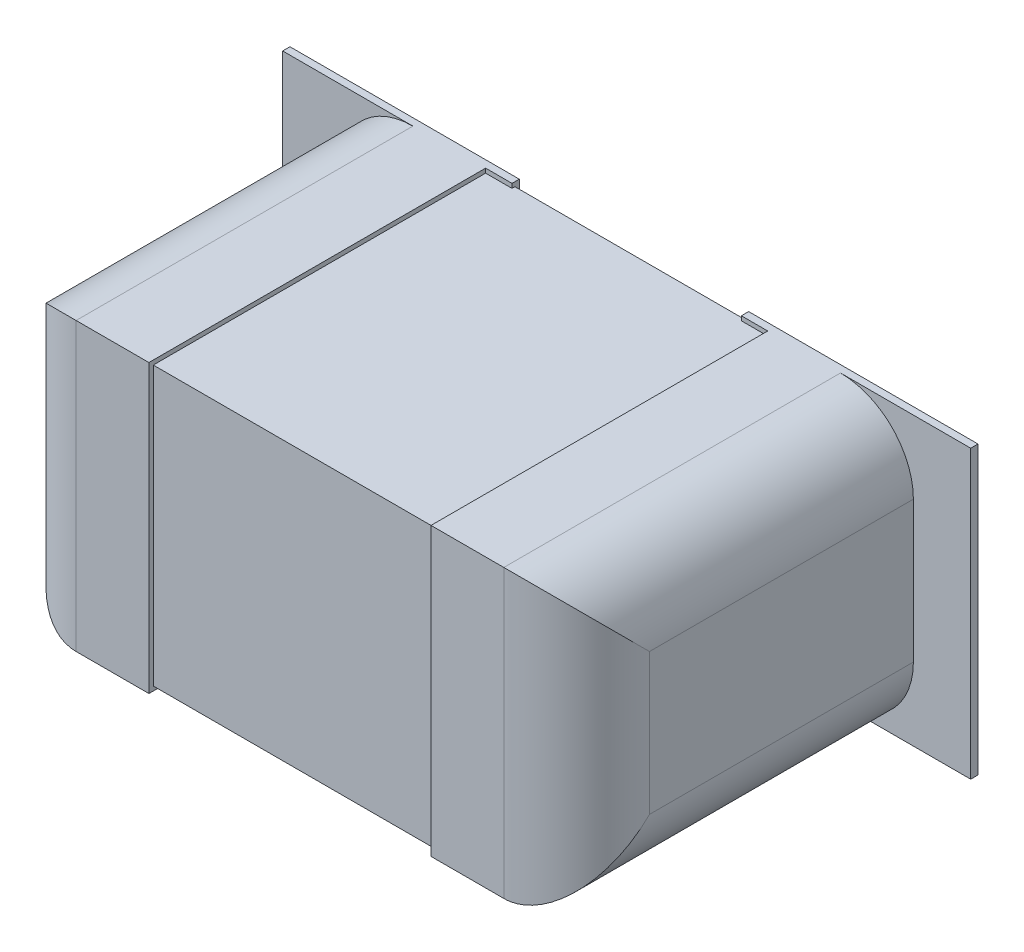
ISO-10303-21;
HEADER;
FILE_DESCRIPTION(('STEP AP214'),'2;1');
FILE_NAME('part.step','',(''),(''),'','','');
FILE_SCHEMA(('AUTOMOTIVE_DESIGN { 1 0 10303 214 1 1 1 1 }'));
ENDSEC;
DATA;
#1=APPLICATION_CONTEXT('core data for automotive mechanical design processes');
#2=APPLICATION_PROTOCOL_DEFINITION('international standard','automotive_design',2000,#1);
#3=PRODUCT_CONTEXT('',#1,'mechanical');
#4=PRODUCT('Part','Part','',(#3));
#5=PRODUCT_RELATED_PRODUCT_CATEGORY('part','',(#4));
#6=PRODUCT_DEFINITION_FORMATION('','',#4);
#7=PRODUCT_DEFINITION_CONTEXT('part definition',#1,'design');
#8=PRODUCT_DEFINITION('design','',#6,#7);
#9=PRODUCT_DEFINITION_SHAPE('','',#8);
#10=(LENGTH_UNIT() NAMED_UNIT(*) SI_UNIT(.MILLI.,.METRE.));
#11=(NAMED_UNIT(*) PLANE_ANGLE_UNIT() SI_UNIT($,.RADIAN.));
#12=(NAMED_UNIT(*) SI_UNIT($,.STERADIAN.) SOLID_ANGLE_UNIT());
#13=UNCERTAINTY_MEASURE_WITH_UNIT(LENGTH_MEASURE(1.E-05),#10,'distance_accuracy_value','');
#14=(GEOMETRIC_REPRESENTATION_CONTEXT(3) GLOBAL_UNCERTAINTY_ASSIGNED_CONTEXT((#13)) GLOBAL_UNIT_ASSIGNED_CONTEXT((#10,
#11,#12)) REPRESENTATION_CONTEXT('',''));
#15=CARTESIAN_POINT('',(0.,0.,0.));
#16=DIRECTION('',(0.,0.,1.));
#17=DIRECTION('',(1.,0.,0.));
#18=AXIS2_PLACEMENT_3D('',#15,#16,#17);
#19=CARTESIAN_POINT('',(0.500000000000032,-0.249999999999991,0.0762));
#20=DIRECTION('',(1.,0.,0.));
#21=DIRECTION('',(0.,0.,-1.));
#22=AXIS2_PLACEMENT_3D('',#19,#20,#21);
#23=PLANE('',#22);
#24=DIRECTION('',(0.,0.,-1.));
#25=VECTOR('',#24,1.);
#26=CARTESIAN_POINT('',(0.500000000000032,-0.122999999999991,0.678388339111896));
#27=LINE('',#26,#25);
#28=CARTESIAN_POINT('',(0.500000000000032,-0.122999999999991,0.0889));
#29=VERTEX_POINT('',#28);
#30=CARTESIAN_POINT('',(0.500000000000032,-0.122999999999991,0.549148));
#31=VERTEX_POINT('',#30);
#32=EDGE_CURVE('E324',#29,#31,#27,.F.);
#33=ORIENTED_EDGE('',*,*,#32,.F.);
#34=DIRECTION('',(0.,1.,0.));
#35=VECTOR('',#34,1.);
#36=CARTESIAN_POINT('',(0.500000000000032,0.,0.0889));
#37=LINE('',#36,#35);
#38=CARTESIAN_POINT('',(0.500000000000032,0.122999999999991,0.0889));
#39=VERTEX_POINT('',#38);
#40=EDGE_CURVE('E237',#39,#29,#37,.F.);
#41=ORIENTED_EDGE('',*,*,#40,.F.);
#42=DIRECTION('',(0.,0.,-1.));
#43=VECTOR('',#42,1.);
#44=CARTESIAN_POINT('',(0.500000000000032,0.122999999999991,0.678388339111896));
#45=LINE('',#44,#43);
#46=CARTESIAN_POINT('',(0.500000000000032,0.122999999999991,0.549148));
#47=VERTEX_POINT('',#46);
#48=EDGE_CURVE('E226',#47,#39,#45,.T.);
#49=ORIENTED_EDGE('',*,*,#48,.F.);
#50=DIRECTION('',(0.,1.,0.));
#51=VECTOR('',#50,1.);
#52=CARTESIAN_POINT('',(0.500000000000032,-0.252159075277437,0.549148));
#53=LINE('',#52,#51);
#54=EDGE_CURVE('E223',#31,#47,#53,.T.);
#55=ORIENTED_EDGE('',*,*,#54,.F.);
#56=EDGE_LOOP('',(#33,#41,#49,#55));
#57=FACE_BOUND('',#56,.T.);
#58=ADVANCED_FACE('F16',(#57),#23,.T.);
#59=CARTESIAN_POINT('',(-0.500000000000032,0.249999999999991,0.0762));
#60=DIRECTION('',(-1.,0.,0.));
#61=DIRECTION('',(0.,0.,1.));
#62=AXIS2_PLACEMENT_3D('',#59,#60,#61);
#63=PLANE('',#62);
#64=DIRECTION('',(0.,0.,-1.));
#65=VECTOR('',#64,1.);
#66=CARTESIAN_POINT('',(-0.500000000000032,0.122999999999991,0.678388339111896));
#67=LINE('',#66,#65);
#68=CARTESIAN_POINT('',(-0.500000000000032,0.122999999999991,0.0889));
#69=VERTEX_POINT('',#68);
#70=CARTESIAN_POINT('',(-0.500000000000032,0.122999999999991,0.549148));
#71=VERTEX_POINT('',#70);
#72=EDGE_CURVE('E308',#69,#71,#67,.F.);
#73=ORIENTED_EDGE('',*,*,#72,.F.);
#74=DIRECTION('',(0.,1.,0.));
#75=VECTOR('',#74,1.);
#76=CARTESIAN_POINT('',(-0.500000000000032,0.,0.0889));
#77=LINE('',#76,#75);
#78=CARTESIAN_POINT('',(-0.500000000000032,-0.122999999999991,0.0889));
#79=VERTEX_POINT('',#78);
#80=EDGE_CURVE('E312',#79,#69,#77,.T.);
#81=ORIENTED_EDGE('',*,*,#80,.F.);
#82=DIRECTION('',(0.,0.,-1.));
#83=VECTOR('',#82,1.);
#84=CARTESIAN_POINT('',(-0.500000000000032,-0.122999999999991,0.678388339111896));
#85=LINE('',#84,#83);
#86=CARTESIAN_POINT('',(-0.500000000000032,-0.122999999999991,0.549148));
#87=VERTEX_POINT('',#86);
#88=EDGE_CURVE('E315',#87,#79,#85,.T.);
#89=ORIENTED_EDGE('',*,*,#88,.F.);
#90=DIRECTION('',(0.,-1.,0.));
#91=VECTOR('',#90,1.);
#92=CARTESIAN_POINT('',(-0.500000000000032,0.252201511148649,0.549148));
#93=LINE('',#92,#91);
#94=EDGE_CURVE('E242',#71,#87,#93,.T.);
#95=ORIENTED_EDGE('',*,*,#94,.F.);
#96=EDGE_LOOP('',(#73,#81,#89,#95));
#97=FACE_BOUND('',#96,.T.);
#98=ADVANCED_FACE('F355',(#97),#63,.T.);
#99=CARTESIAN_POINT('',(-0.373000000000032,0.252201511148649,0.549148));
#100=DIRECTION('',(0.,-1.,0.));
#101=DIRECTION('',(0.,0.,-1.));
#102=AXIS2_PLACEMENT_3D('',#99,#100,#101);
#103=CYLINDRICAL_SURFACE('',#102,0.127);
#104=CARTESIAN_POINT('',(-0.373000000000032,-0.122999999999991,0.549148));
#105=DIRECTION('',(0.,-0.707106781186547,-0.707106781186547));
#106=DIRECTION('',(0.,0.707106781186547,-0.707106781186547));
#107=AXIS2_PLACEMENT_3D('',#104,#105,#106);
#108=ELLIPSE('',#107,0.179605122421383,0.127);
#109=CARTESIAN_POINT('',(-0.373000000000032,-0.249999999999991,0.676148));
#110=VERTEX_POINT('',#109);
#111=EDGE_CURVE('E316',#110,#87,#108,.T.);
#112=ORIENTED_EDGE('',*,*,#111,.F.);
#113=DIRECTION('',(0.,1.,0.));
#114=VECTOR('',#113,1.);
#115=CARTESIAN_POINT('',(-0.373000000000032,0.,0.676148));
#116=LINE('',#115,#114);
#117=CARTESIAN_POINT('',(-0.373000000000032,0.249999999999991,0.676148));
#118=VERTEX_POINT('',#117);
#119=EDGE_CURVE('E207',#118,#110,#116,.F.);
#120=ORIENTED_EDGE('',*,*,#119,.F.);
#121=CARTESIAN_POINT('',(-0.373000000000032,0.122999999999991,0.549148));
#122=DIRECTION('',(0.,0.707106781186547,-0.707106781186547));
#123=DIRECTION('',(0.,-0.707106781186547,-0.707106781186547));
#124=AXIS2_PLACEMENT_3D('',#121,#122,#123);
#125=ELLIPSE('',#124,0.179605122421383,0.127);
#126=EDGE_CURVE('E306',#71,#118,#125,.T.);
#127=ORIENTED_EDGE('',*,*,#126,.F.);
#128=ORIENTED_EDGE('',*,*,#94,.T.);
#129=EDGE_LOOP('',(#112,#120,#127,#128));
#130=FACE_BOUND('',#129,.T.);
#131=ADVANCED_FACE('F360',(#130),#103,.T.);
#132=CARTESIAN_POINT('',(0.373000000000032,-0.252159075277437,0.549148));
#133=DIRECTION('',(0.,1.,0.));
#134=DIRECTION('',(0.,0.,1.));
#135=AXIS2_PLACEMENT_3D('',#132,#133,#134);
#136=CYLINDRICAL_SURFACE('',#135,0.127);
#137=CARTESIAN_POINT('',(0.373000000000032,-0.122999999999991,0.549148));
#138=DIRECTION('',(0.,-0.707106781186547,-0.707106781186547));
#139=DIRECTION('',(0.,0.707106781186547,-0.707106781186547));
#140=AXIS2_PLACEMENT_3D('',#137,#138,#139);
#141=ELLIPSE('',#140,0.179605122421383,0.127);
#142=CARTESIAN_POINT('',(0.373000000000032,-0.249999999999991,0.676148));
#143=VERTEX_POINT('',#142);
#144=EDGE_CURVE('E322',#31,#143,#141,.T.);
#145=ORIENTED_EDGE('',*,*,#144,.F.);
#146=ORIENTED_EDGE('',*,*,#54,.T.);
#147=CARTESIAN_POINT('',(0.373000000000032,0.122999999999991,0.549148));
#148=DIRECTION('',(0.,0.707106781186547,-0.707106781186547));
#149=DIRECTION('',(0.,-0.707106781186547,-0.707106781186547));
#150=AXIS2_PLACEMENT_3D('',#147,#148,#149);
#151=ELLIPSE('',#150,0.179605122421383,0.127);
#152=CARTESIAN_POINT('',(0.373000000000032,0.249999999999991,0.676148));
#153=VERTEX_POINT('',#152);
#154=EDGE_CURVE('E19',#153,#47,#151,.T.);
#155=ORIENTED_EDGE('',*,*,#154,.F.);
#156=DIRECTION('',(0.,1.,0.));
#157=VECTOR('',#156,1.);
#158=CARTESIAN_POINT('',(0.373000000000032,0.,0.676148));
#159=LINE('',#158,#157);
#160=EDGE_CURVE('E197',#143,#153,#159,.T.);
#161=ORIENTED_EDGE('',*,*,#160,.F.);
#162=EDGE_LOOP('',(#145,#146,#155,#161));
#163=FACE_BOUND('',#162,.T.);
#164=ADVANCED_FACE('F221',(#163),#136,.T.);
#165=CARTESIAN_POINT('',(0.373000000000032,0.122999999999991,0.678388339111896));
#166=DIRECTION('',(0.,0.,-1.));
#167=DIRECTION('',(-1.,0.,0.));
#168=AXIS2_PLACEMENT_3D('',#165,#166,#167);
#169=CYLINDRICAL_SURFACE('',#168,0.127);
#170=ORIENTED_EDGE('',*,*,#48,.T.);
#171=CARTESIAN_POINT('',(0.373000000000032,0.122999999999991,0.0889));
#172=DIRECTION('',(0.,0.,-1.));
#173=DIRECTION('',(-1.,0.,0.));
#174=AXIS2_PLACEMENT_3D('',#171,#172,#173);
#175=CIRCLE('',#174,0.127);
#176=CARTESIAN_POINT('',(0.37286056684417,0.249999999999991,0.0889000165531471));
#177=VERTEX_POINT('',#176);
#178=EDGE_CURVE('E229',#177,#39,#175,.T.);
#179=ORIENTED_EDGE('',*,*,#178,.F.);
#180=DIRECTION('',(-0.000237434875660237,0.,-0.999999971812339));
#181=VECTOR('',#180,1.);
#182=CARTESIAN_POINT('',(0.373000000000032,0.249999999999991,0.676148));
#183=LINE('',#182,#181);
#184=EDGE_CURVE('E214',#153,#177,#183,.T.);
#185=ORIENTED_EDGE('',*,*,#184,.F.);
#186=ORIENTED_EDGE('',*,*,#154,.T.);
#187=EDGE_LOOP('',(#170,#179,#185,#186));
#188=FACE_BOUND('',#187,.T.);
#189=ADVANCED_FACE('F227',(#188),#169,.T.);
#190=CARTESIAN_POINT('',(0.5999988,-0.2500122,0.0762));
#191=DIRECTION('',(1.,0.,0.));
#192=DIRECTION('',(0.,0.,-1.));
#193=AXIS2_PLACEMENT_3D('',#190,#191,#192);
#194=PLANE('',#193);
#195=DIRECTION('',(0.,0.,-1.));
#196=VECTOR('',#195,1.);
#197=CARTESIAN_POINT('',(0.5999988,-0.249999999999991,0.0762));
#198=LINE('',#197,#196);
#199=CARTESIAN_POINT('',(0.5999988,-0.249999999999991,0.0762));
#200=VERTEX_POINT('',#199);
#201=CARTESIAN_POINT('',(0.5999988,-0.249999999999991,0.0889));
#202=VERTEX_POINT('',#201);
#203=EDGE_CURVE('E294',#200,#202,#198,.F.);
#204=ORIENTED_EDGE('',*,*,#203,.F.);
#205=DIRECTION('',(0.,1.,0.));
#206=VECTOR('',#205,1.);
#207=CARTESIAN_POINT('',(0.5999988,0.,0.0762));
#208=LINE('',#207,#206);
#209=CARTESIAN_POINT('',(0.5999988,0.249999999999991,0.0762));
#210=VERTEX_POINT('',#209);
#211=EDGE_CURVE('E297',#200,#210,#208,.T.);
#212=ORIENTED_EDGE('',*,*,#211,.T.);
#213=DIRECTION('',(0.,0.,1.));
#214=VECTOR('',#213,1.);
#215=CARTESIAN_POINT('',(0.5999988,0.249999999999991,0.0762));
#216=LINE('',#215,#214);
#217=CARTESIAN_POINT('',(0.5999988,0.249999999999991,0.0889));
#218=VERTEX_POINT('',#217);
#219=EDGE_CURVE('E233',#218,#210,#216,.F.);
#220=ORIENTED_EDGE('',*,*,#219,.F.);
#221=DIRECTION('',(0.,1.,0.));
#222=VECTOR('',#221,1.);
#223=CARTESIAN_POINT('',(0.5999988,0.,0.0889));
#224=LINE('',#223,#222);
#225=EDGE_CURVE('E240',#202,#218,#224,.T.);
#226=ORIENTED_EDGE('',*,*,#225,.F.);
#227=EDGE_LOOP('',(#204,#212,#220,#226));
#228=FACE_BOUND('',#227,.T.);
#229=ADVANCED_FACE('F335',(#228),#194,.T.);
#230=CARTESIAN_POINT('',(0.,0.,0.0889));
#231=DIRECTION('',(0.,0.,1.));
#232=DIRECTION('',(1.,0.,0.));
#233=AXIS2_PLACEMENT_3D('',#230,#231,#232);
#234=PLANE('',#233);
#235=ORIENTED_EDGE('',*,*,#178,.T.);
#236=ORIENTED_EDGE('',*,*,#40,.T.);
#237=CARTESIAN_POINT('',(0.373000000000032,-0.122999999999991,0.0889));
#238=DIRECTION('',(0.,0.,-1.));
#239=DIRECTION('',(-1.,0.,0.));
#240=AXIS2_PLACEMENT_3D('',#237,#238,#239);
#241=CIRCLE('',#240,0.127);
#242=CARTESIAN_POINT('',(0.37286056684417,-0.249999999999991,0.088900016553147));
#243=VERTEX_POINT('',#242);
#244=EDGE_CURVE('E319',#243,#29,#241,.F.);
#245=ORIENTED_EDGE('',*,*,#244,.F.);
#246=DIRECTION('',(1.,0.,0.));
#247=VECTOR('',#246,1.);
#248=CARTESIAN_POINT('',(-0.500000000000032,-0.249999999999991,0.0889));
#249=LINE('',#248,#247);
#250=EDGE_CURVE('E296',#202,#243,#249,.F.);
#251=ORIENTED_EDGE('',*,*,#250,.F.);
#252=ORIENTED_EDGE('',*,*,#225,.T.);
#253=DIRECTION('',(1.,0.,0.));
#254=VECTOR('',#253,1.);
#255=CARTESIAN_POINT('',(0.500000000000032,0.249999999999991,0.0889));
#256=LINE('',#255,#254);
#257=EDGE_CURVE('E231',#177,#218,#256,.T.);
#258=ORIENTED_EDGE('',*,*,#257,.F.);
#259=EDGE_LOOP('',(#235,#236,#245,#251,#252,#258));
#260=FACE_BOUND('',#259,.T.);
#261=ADVANCED_FACE('F328',(#260),#234,.T.);
#262=CARTESIAN_POINT('',(0.373000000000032,-0.122999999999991,0.678388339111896));
#263=DIRECTION('',(0.,0.,-1.));
#264=DIRECTION('',(-1.,0.,0.));
#265=AXIS2_PLACEMENT_3D('',#262,#263,#264);
#266=CYLINDRICAL_SURFACE('',#265,0.127);
#267=DIRECTION('',(0.000237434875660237,0.,0.999999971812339));
#268=VECTOR('',#267,1.);
#269=CARTESIAN_POINT('',(0.37286056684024,-0.249999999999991,0.0889));
#270=LINE('',#269,#268);
#271=EDGE_CURVE('E342',#243,#143,#270,.T.);
#272=ORIENTED_EDGE('',*,*,#271,.F.);
#273=ORIENTED_EDGE('',*,*,#244,.T.);
#274=ORIENTED_EDGE('',*,*,#32,.T.);
#275=ORIENTED_EDGE('',*,*,#144,.T.);
#276=EDGE_LOOP('',(#272,#273,#274,#275));
#277=FACE_BOUND('',#276,.T.);
#278=ADVANCED_FACE('F352',(#277),#266,.T.);
#279=CARTESIAN_POINT('',(-0.373000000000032,-0.122999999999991,0.678388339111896));
#280=DIRECTION('',(0.,0.,-1.));
#281=DIRECTION('',(-1.,0.,0.));
#282=AXIS2_PLACEMENT_3D('',#279,#280,#281);
#283=CYLINDRICAL_SURFACE('',#282,0.127);
#284=ORIENTED_EDGE('',*,*,#88,.T.);
#285=CARTESIAN_POINT('',(-0.373000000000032,-0.122999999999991,0.0889));
#286=DIRECTION('',(0.,0.,-1.));
#287=DIRECTION('',(-1.,0.,0.));
#288=AXIS2_PLACEMENT_3D('',#285,#286,#287);
#289=CIRCLE('',#288,0.127);
#290=CARTESIAN_POINT('',(-0.37286056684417,-0.249999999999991,0.0889000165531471));
#291=VERTEX_POINT('',#290);
#292=EDGE_CURVE('E309',#291,#79,#289,.T.);
#293=ORIENTED_EDGE('',*,*,#292,.F.);
#294=DIRECTION('',(0.000237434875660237,0.,-0.999999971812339));
#295=VECTOR('',#294,1.);
#296=CARTESIAN_POINT('',(-0.373000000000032,-0.249999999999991,0.676148));
#297=LINE('',#296,#295);
#298=EDGE_CURVE('E289',#110,#291,#297,.T.);
#299=ORIENTED_EDGE('',*,*,#298,.F.);
#300=ORIENTED_EDGE('',*,*,#111,.T.);
#301=EDGE_LOOP('',(#284,#293,#299,#300));
#302=FACE_BOUND('',#301,.T.);
#303=ADVANCED_FACE('F449',(#302),#283,.T.);
#304=CARTESIAN_POINT('',(-0.5999988,0.2500122,0.0762));
#305=DIRECTION('',(-1.,0.,0.));
#306=DIRECTION('',(0.,0.,1.));
#307=AXIS2_PLACEMENT_3D('',#304,#305,#306);
#308=PLANE('',#307);
#309=DIRECTION('',(0.,0.,1.));
#310=VECTOR('',#309,1.);
#311=CARTESIAN_POINT('',(-0.5999988,0.249999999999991,0.0762));
#312=LINE('',#311,#310);
#313=CARTESIAN_POINT('',(-0.5999988,0.249999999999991,0.0762));
#314=VERTEX_POINT('',#313);
#315=CARTESIAN_POINT('',(-0.5999988,0.249999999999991,0.0889));
#316=VERTEX_POINT('',#315);
#317=EDGE_CURVE('E277',#314,#316,#312,.T.);
#318=ORIENTED_EDGE('',*,*,#317,.F.);
#319=DIRECTION('',(0.,1.,0.));
#320=VECTOR('',#319,1.);
#321=CARTESIAN_POINT('',(-0.5999988,0.,0.0762));
#322=LINE('',#321,#320);
#323=CARTESIAN_POINT('',(-0.5999988,-0.249999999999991,0.0762));
#324=VERTEX_POINT('',#323);
#325=EDGE_CURVE('E280',#314,#324,#322,.F.);
#326=ORIENTED_EDGE('',*,*,#325,.T.);
#327=DIRECTION('',(0.,0.,-1.));
#328=VECTOR('',#327,1.);
#329=CARTESIAN_POINT('',(-0.5999988,-0.249999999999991,0.0762));
#330=LINE('',#329,#328);
#331=CARTESIAN_POINT('',(-0.5999988,-0.249999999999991,0.0889));
#332=VERTEX_POINT('',#331);
#333=EDGE_CURVE('E284',#332,#324,#330,.T.);
#334=ORIENTED_EDGE('',*,*,#333,.F.);
#335=DIRECTION('',(0.,1.,0.));
#336=VECTOR('',#335,1.);
#337=CARTESIAN_POINT('',(-0.5999988,0.,0.0889));
#338=LINE('',#337,#336);
#339=EDGE_CURVE('E313',#316,#332,#338,.F.);
#340=ORIENTED_EDGE('',*,*,#339,.F.);
#341=EDGE_LOOP('',(#318,#326,#334,#340));
#342=FACE_BOUND('',#341,.T.);
#343=ADVANCED_FACE('F445',(#342),#308,.T.);
#344=CARTESIAN_POINT('',(0.,0.,0.0889));
#345=DIRECTION('',(0.,0.,1.));
#346=DIRECTION('',(1.,0.,0.));
#347=AXIS2_PLACEMENT_3D('',#344,#345,#346);
#348=PLANE('',#347);
#349=ORIENTED_EDGE('',*,*,#292,.T.);
#350=ORIENTED_EDGE('',*,*,#80,.T.);
#351=CARTESIAN_POINT('',(-0.373000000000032,0.122999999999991,0.0889));
#352=DIRECTION('',(0.,0.,-1.));
#353=DIRECTION('',(-1.,0.,0.));
#354=AXIS2_PLACEMENT_3D('',#351,#352,#353);
#355=CIRCLE('',#354,0.127);
#356=CARTESIAN_POINT('',(-0.37286056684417,0.249999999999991,0.088900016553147));
#357=VERTEX_POINT('',#356);
#358=EDGE_CURVE('E303',#357,#69,#355,.F.);
#359=ORIENTED_EDGE('',*,*,#358,.F.);
#360=DIRECTION('',(1.,0.,0.));
#361=VECTOR('',#360,1.);
#362=CARTESIAN_POINT('',(0.500000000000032,0.249999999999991,0.0889));
#363=LINE('',#362,#361);
#364=EDGE_CURVE('E279',#316,#357,#363,.T.);
#365=ORIENTED_EDGE('',*,*,#364,.F.);
#366=ORIENTED_EDGE('',*,*,#339,.T.);
#367=DIRECTION('',(1.,0.,0.));
#368=VECTOR('',#367,1.);
#369=CARTESIAN_POINT('',(-0.500000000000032,-0.249999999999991,0.0889));
#370=LINE('',#369,#368);
#371=EDGE_CURVE('E286',#291,#332,#370,.F.);
#372=ORIENTED_EDGE('',*,*,#371,.F.);
#373=EDGE_LOOP('',(#349,#350,#359,#365,#366,#372));
#374=FACE_BOUND('',#373,.T.);
#375=ADVANCED_FACE('F441',(#374),#348,.T.);
#376=CARTESIAN_POINT('',(-0.373000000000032,0.122999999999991,0.678388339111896));
#377=DIRECTION('',(0.,0.,-1.));
#378=DIRECTION('',(-1.,0.,0.));
#379=AXIS2_PLACEMENT_3D('',#376,#377,#378);
#380=CYLINDRICAL_SURFACE('',#379,0.127);
#381=DIRECTION('',(-0.000237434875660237,0.,0.999999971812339));
#382=VECTOR('',#381,1.);
#383=CARTESIAN_POINT('',(-0.37286056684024,0.249999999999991,0.0889));
#384=LINE('',#383,#382);
#385=EDGE_CURVE('E482',#357,#118,#384,.T.);
#386=ORIENTED_EDGE('',*,*,#385,.F.);
#387=ORIENTED_EDGE('',*,*,#358,.T.);
#388=ORIENTED_EDGE('',*,*,#72,.T.);
#389=ORIENTED_EDGE('',*,*,#126,.T.);
#390=EDGE_LOOP('',(#386,#387,#388,#389));
#391=FACE_BOUND('',#390,.T.);
#392=ADVANCED_FACE('F437',(#391),#380,.T.);
#393=CARTESIAN_POINT('',(0.,0.,0.676148));
#394=DIRECTION('',(0.,0.,1.));
#395=DIRECTION('',(1.,0.,0.));
#396=AXIS2_PLACEMENT_3D('',#393,#394,#395);
#397=PLANE('',#396);
#398=DIRECTION('',(1.,0.,0.));
#399=VECTOR('',#398,1.);
#400=CARTESIAN_POINT('',(0.500000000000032,0.249999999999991,0.676148));
#401=LINE('',#400,#399);
#402=CARTESIAN_POINT('',(-0.246000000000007,0.249999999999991,0.676148));
#403=VERTEX_POINT('',#402);
#404=EDGE_CURVE('E276',#118,#403,#401,.T.);
#405=ORIENTED_EDGE('',*,*,#404,.F.);
#406=ORIENTED_EDGE('',*,*,#119,.T.);
#407=DIRECTION('',(1.,0.,0.));
#408=VECTOR('',#407,1.);
#409=CARTESIAN_POINT('',(-0.500000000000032,-0.249999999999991,0.676148));
#410=LINE('',#409,#408);
#411=CARTESIAN_POINT('',(-0.246000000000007,-0.250002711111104,0.676148));
#412=VERTEX_POINT('',#411);
#413=EDGE_CURVE('E293',#412,#110,#410,.F.);
#414=ORIENTED_EDGE('',*,*,#413,.F.);
#415=DIRECTION('',(0.,1.,0.));
#416=VECTOR('',#415,1.);
#417=CARTESIAN_POINT('',(-0.246000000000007,-0.249999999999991,0.676148));
#418=LINE('',#417,#416);
#419=EDGE_CURVE('E513',#412,#403,#418,.T.);
#420=ORIENTED_EDGE('',*,*,#419,.T.);
#421=EDGE_LOOP('',(#405,#406,#414,#420));
#422=FACE_BOUND('',#421,.T.);
#423=ADVANCED_FACE('F434',(#422),#397,.T.);
#424=CARTESIAN_POINT('',(0.,0.,0.676148));
#425=DIRECTION('',(0.,0.,1.));
#426=DIRECTION('',(1.,0.,0.));
#427=AXIS2_PLACEMENT_3D('',#424,#425,#426);
#428=PLANE('',#427);
#429=DIRECTION('',(1.,0.,0.));
#430=VECTOR('',#429,1.);
#431=CARTESIAN_POINT('',(-0.500000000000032,-0.249999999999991,0.676148));
#432=LINE('',#431,#430);
#433=CARTESIAN_POINT('',(0.246000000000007,-0.249999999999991,0.676148));
#434=VERTEX_POINT('',#433);
#435=EDGE_CURVE('E203',#143,#434,#432,.F.);
#436=ORIENTED_EDGE('',*,*,#435,.F.);
#437=ORIENTED_EDGE('',*,*,#160,.T.);
#438=DIRECTION('',(1.,0.,0.));
#439=VECTOR('',#438,1.);
#440=CARTESIAN_POINT('',(0.500000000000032,0.249999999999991,0.676148));
#441=LINE('',#440,#439);
#442=CARTESIAN_POINT('',(0.246000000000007,0.250002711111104,0.676148));
#443=VERTEX_POINT('',#442);
#444=EDGE_CURVE('E201',#443,#153,#441,.T.);
#445=ORIENTED_EDGE('',*,*,#444,.F.);
#446=DIRECTION('',(0.,1.,0.));
#447=VECTOR('',#446,1.);
#448=CARTESIAN_POINT('',(0.246000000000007,-0.249999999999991,0.676148));
#449=LINE('',#448,#447);
#450=EDGE_CURVE('E568',#443,#434,#449,.F.);
#451=ORIENTED_EDGE('',*,*,#450,.T.);
#452=EDGE_LOOP('',(#436,#437,#445,#451));
#453=FACE_BOUND('',#452,.T.);
#454=ADVANCED_FACE('F199',(#453),#428,.T.);
#455=CARTESIAN_POINT('',(0.,0.,0.0889));
#456=DIRECTION('',(0.,0.,1.));
#457=DIRECTION('',(1.,0.,0.));
#458=AXIS2_PLACEMENT_3D('',#455,#456,#457);
#459=PLANE('',#458);
#460=DIRECTION('',(1.,0.,0.));
#461=VECTOR('',#460,1.);
#462=CARTESIAN_POINT('',(-0.246000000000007,0.242379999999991,0.0889));
#463=LINE('',#462,#461);
#464=CARTESIAN_POINT('',(0.1999996,0.242379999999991,0.0889));
#465=VERTEX_POINT('',#464);
#466=CARTESIAN_POINT('',(0.246000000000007,0.242379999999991,0.0889));
#467=VERTEX_POINT('',#466);
#468=EDGE_CURVE('E529',#465,#467,#463,.T.);
#469=ORIENTED_EDGE('',*,*,#468,.T.);
#470=DIRECTION('',(0.,1.,0.));
#471=VECTOR('',#470,1.);
#472=CARTESIAN_POINT('',(0.246000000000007,-0.249999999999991,0.0889));
#473=LINE('',#472,#471);
#474=CARTESIAN_POINT('',(0.246000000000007,0.250002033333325,0.0889));
#475=VERTEX_POINT('',#474);
#476=EDGE_CURVE('E558',#467,#475,#473,.T.);
#477=ORIENTED_EDGE('',*,*,#476,.T.);
#478=DIRECTION('',(1.,0.,0.));
#479=VECTOR('',#478,1.);
#480=CARTESIAN_POINT('',(0.500000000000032,0.249999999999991,0.0889));
#481=LINE('',#480,#479);
#482=CARTESIAN_POINT('',(0.1999996,0.249999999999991,0.0889));
#483=VERTEX_POINT('',#482);
#484=EDGE_CURVE('E301',#483,#475,#481,.T.);
#485=ORIENTED_EDGE('',*,*,#484,.F.);
#486=DIRECTION('',(0.,1.,0.));
#487=VECTOR('',#486,1.);
#488=CARTESIAN_POINT('',(0.1999996,0.2500122,0.0889));
#489=LINE('',#488,#487);
#490=EDGE_CURVE('E257',#465,#483,#489,.T.);
#491=ORIENTED_EDGE('',*,*,#490,.F.);
#492=EDGE_LOOP('',(#469,#477,#485,#491));
#493=FACE_BOUND('',#492,.T.);
#494=ADVANCED_FACE('F428',(#493),#459,.T.);
#495=CARTESIAN_POINT('',(0.500000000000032,0.249999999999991,0.0762));
#496=DIRECTION('',(0.,1.,0.));
#497=DIRECTION('',(0.,0.,1.));
#498=AXIS2_PLACEMENT_3D('',#495,#496,#497);
#499=PLANE('',#498);
#500=ORIENTED_EDGE('',*,*,#484,.T.);
#501=DIRECTION('',(0.,0.,-1.));
#502=VECTOR('',#501,1.);
#503=CARTESIAN_POINT('',(0.246000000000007,0.25000406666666,0.08382));
#504=LINE('',#503,#502);
#505=EDGE_CURVE('E217',#475,#443,#504,.F.);
#506=ORIENTED_EDGE('',*,*,#505,.T.);
#507=ORIENTED_EDGE('',*,*,#444,.T.);
#508=ORIENTED_EDGE('',*,*,#184,.T.);
#509=ORIENTED_EDGE('',*,*,#257,.T.);
#510=ORIENTED_EDGE('',*,*,#219,.T.);
#511=DIRECTION('',(1.,0.,0.));
#512=VECTOR('',#511,1.);
#513=CARTESIAN_POINT('',(0.500000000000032,0.249999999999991,0.0762));
#514=LINE('',#513,#512);
#515=CARTESIAN_POINT('',(0.1999996,0.249999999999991,0.0762));
#516=VERTEX_POINT('',#515);
#517=EDGE_CURVE('E298',#210,#516,#514,.F.);
#518=ORIENTED_EDGE('',*,*,#517,.T.);
#519=DIRECTION('',(0.,0.,-1.));
#520=VECTOR('',#519,1.);
#521=CARTESIAN_POINT('',(0.1999996,0.249999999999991,0.0762));
#522=LINE('',#521,#520);
#523=EDGE_CURVE('E255',#483,#516,#522,.T.);
#524=ORIENTED_EDGE('',*,*,#523,.F.);
#525=EDGE_LOOP('',(#500,#506,#507,#508,#509,#510,#518,#524));
#526=FACE_BOUND('',#525,.T.);
#527=ADVANCED_FACE('F211',(#526),#499,.T.);
#528=CARTESIAN_POINT('',(0.,0.,0.0762));
#529=DIRECTION('',(0.,0.,1.));
#530=DIRECTION('',(1.,0.,0.));
#531=AXIS2_PLACEMENT_3D('',#528,#529,#530);
#532=PLANE('',#531);
#533=DIRECTION('',(1.,0.,0.));
#534=VECTOR('',#533,1.);
#535=CARTESIAN_POINT('',(-0.500000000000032,-0.249999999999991,0.0762));
#536=LINE('',#535,#534);
#537=CARTESIAN_POINT('',(0.1999996,-0.249999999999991,0.0762));
#538=VERTEX_POINT('',#537);
#539=EDGE_CURVE('E290',#538,#200,#536,.T.);
#540=ORIENTED_EDGE('',*,*,#539,.F.);
#541=DIRECTION('',(0.,1.,0.));
#542=VECTOR('',#541,1.);
#543=CARTESIAN_POINT('',(0.1999996,0.2500122,0.0762));
#544=LINE('',#543,#542);
#545=EDGE_CURVE('E254',#516,#538,#544,.F.);
#546=ORIENTED_EDGE('',*,*,#545,.F.);
#547=ORIENTED_EDGE('',*,*,#517,.F.);
#548=ORIENTED_EDGE('',*,*,#211,.F.);
#549=EDGE_LOOP('',(#540,#546,#547,#548));
#550=FACE_BOUND('',#549,.T.);
#551=ADVANCED_FACE('F423',(#550),#532,.F.);
#552=CARTESIAN_POINT('',(-0.500000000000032,-0.249999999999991,0.0762));
#553=DIRECTION('',(0.,-1.,0.));
#554=DIRECTION('',(0.,0.,-1.));
#555=AXIS2_PLACEMENT_3D('',#552,#553,#554);
#556=PLANE('',#555);
#557=DIRECTION('',(0.,0.,1.));
#558=VECTOR('',#557,1.);
#559=CARTESIAN_POINT('',(0.1999996,-0.249999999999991,0.0762));
#560=LINE('',#559,#558);
#561=CARTESIAN_POINT('',(0.1999996,-0.249999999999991,0.0889));
#562=VERTEX_POINT('',#561);
#563=EDGE_CURVE('E251',#538,#562,#560,.T.);
#564=ORIENTED_EDGE('',*,*,#563,.F.);
#565=ORIENTED_EDGE('',*,*,#539,.T.);
#566=ORIENTED_EDGE('',*,*,#203,.T.);
#567=ORIENTED_EDGE('',*,*,#250,.T.);
#568=ORIENTED_EDGE('',*,*,#271,.T.);
#569=ORIENTED_EDGE('',*,*,#435,.T.);
#570=DIRECTION('',(0.,0.,-1.));
#571=VECTOR('',#570,1.);
#572=CARTESIAN_POINT('',(0.246000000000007,-0.249999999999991,0.08382));
#573=LINE('',#572,#571);
#574=CARTESIAN_POINT('',(0.246000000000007,-0.249999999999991,0.0889));
#575=VERTEX_POINT('',#574);
#576=EDGE_CURVE('E264',#434,#575,#573,.T.);
#577=ORIENTED_EDGE('',*,*,#576,.T.);
#578=DIRECTION('',(1.,0.,0.));
#579=VECTOR('',#578,1.);
#580=CARTESIAN_POINT('',(0.,-0.249999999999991,0.0889));
#581=LINE('',#580,#579);
#582=EDGE_CURVE('E258',#562,#575,#581,.T.);
#583=ORIENTED_EDGE('',*,*,#582,.F.);
#584=EDGE_LOOP('',(#564,#565,#566,#567,#568,#569,#577,#583));
#585=FACE_BOUND('',#584,.T.);
#586=ADVANCED_FACE('F347',(#585),#556,.T.);
#587=CARTESIAN_POINT('',(-0.500000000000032,-0.249999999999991,0.0762));
#588=DIRECTION('',(0.,-1.,0.));
#589=DIRECTION('',(0.,0.,-1.));
#590=AXIS2_PLACEMENT_3D('',#587,#588,#589);
#591=PLANE('',#590);
#592=DIRECTION('',(1.,0.,0.));
#593=VECTOR('',#592,1.);
#594=CARTESIAN_POINT('',(0.,-0.25000406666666,0.0889));
#595=LINE('',#594,#593);
#596=CARTESIAN_POINT('',(-0.246000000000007,-0.250003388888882,0.0889));
#597=VERTEX_POINT('',#596);
#598=CARTESIAN_POINT('',(-0.1999996,-0.250002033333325,0.0889));
#599=VERTEX_POINT('',#598);
#600=EDGE_CURVE('E506',#597,#599,#595,.T.);
#601=ORIENTED_EDGE('',*,*,#600,.F.);
#602=DIRECTION('',(0.,0.,1.));
#603=VECTOR('',#602,1.);
#604=CARTESIAN_POINT('',(-0.246000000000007,-0.25000406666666,0.0762));
#605=LINE('',#604,#603);
#606=EDGE_CURVE('E505',#597,#412,#605,.T.);
#607=ORIENTED_EDGE('',*,*,#606,.T.);
#608=ORIENTED_EDGE('',*,*,#413,.T.);
#609=ORIENTED_EDGE('',*,*,#298,.T.);
#610=ORIENTED_EDGE('',*,*,#371,.T.);
#611=ORIENTED_EDGE('',*,*,#333,.T.);
#612=DIRECTION('',(1.,0.,0.));
#613=VECTOR('',#612,1.);
#614=CARTESIAN_POINT('',(-0.500000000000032,-0.249999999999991,0.0762));
#615=LINE('',#614,#613);
#616=CARTESIAN_POINT('',(-0.1999996,-0.249999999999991,0.0762));
#617=VERTEX_POINT('',#616);
#618=EDGE_CURVE('E281',#324,#617,#615,.T.);
#619=ORIENTED_EDGE('',*,*,#618,.T.);
#620=DIRECTION('',(0.,0.,-1.));
#621=VECTOR('',#620,1.);
#622=CARTESIAN_POINT('',(-0.1999996,-0.249999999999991,0.0762));
#623=LINE('',#622,#621);
#624=EDGE_CURVE('E248',#599,#617,#623,.T.);
#625=ORIENTED_EDGE('',*,*,#624,.F.);
#626=EDGE_LOOP('',(#601,#607,#608,#609,#610,#611,#619,#625));
#627=FACE_BOUND('',#626,.T.);
#628=ADVANCED_FACE('F416',(#627),#591,.T.);
#629=CARTESIAN_POINT('',(0.,0.,0.0762));
#630=DIRECTION('',(0.,0.,1.));
#631=DIRECTION('',(1.,0.,0.));
#632=AXIS2_PLACEMENT_3D('',#629,#630,#631);
#633=PLANE('',#632);
#634=DIRECTION('',(1.,0.,0.));
#635=VECTOR('',#634,1.);
#636=CARTESIAN_POINT('',(0.500000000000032,0.249999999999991,0.0762));
#637=LINE('',#636,#635);
#638=CARTESIAN_POINT('',(-0.1999996,0.249999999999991,0.0762));
#639=VERTEX_POINT('',#638);
#640=EDGE_CURVE('E273',#639,#314,#637,.F.);
#641=ORIENTED_EDGE('',*,*,#640,.F.);
#642=DIRECTION('',(0.,1.,0.));
#643=VECTOR('',#642,1.);
#644=CARTESIAN_POINT('',(-0.1999996,-0.2500122,0.0762));
#645=LINE('',#644,#643);
#646=EDGE_CURVE('E247',#617,#639,#645,.T.);
#647=ORIENTED_EDGE('',*,*,#646,.F.);
#648=ORIENTED_EDGE('',*,*,#618,.F.);
#649=ORIENTED_EDGE('',*,*,#325,.F.);
#650=EDGE_LOOP('',(#641,#647,#648,#649));
#651=FACE_BOUND('',#650,.T.);
#652=ADVANCED_FACE('F412',(#651),#633,.F.);
#653=CARTESIAN_POINT('',(0.500000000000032,0.249999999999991,0.0762));
#654=DIRECTION('',(0.,1.,0.));
#655=DIRECTION('',(0.,0.,1.));
#656=AXIS2_PLACEMENT_3D('',#653,#654,#655);
#657=PLANE('',#656);
#658=DIRECTION('',(0.,0.,1.));
#659=VECTOR('',#658,1.);
#660=CARTESIAN_POINT('',(-0.1999996,0.249999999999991,0.0762));
#661=LINE('',#660,#659);
#662=CARTESIAN_POINT('',(-0.1999996,0.249999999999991,0.0889));
#663=VERTEX_POINT('',#662);
#664=EDGE_CURVE('E244',#639,#663,#661,.T.);
#665=ORIENTED_EDGE('',*,*,#664,.F.);
#666=ORIENTED_EDGE('',*,*,#640,.T.);
#667=ORIENTED_EDGE('',*,*,#317,.T.);
#668=ORIENTED_EDGE('',*,*,#364,.T.);
#669=ORIENTED_EDGE('',*,*,#385,.T.);
#670=ORIENTED_EDGE('',*,*,#404,.T.);
#671=DIRECTION('',(0.,0.,1.));
#672=VECTOR('',#671,1.);
#673=CARTESIAN_POINT('',(-0.246000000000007,0.249999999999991,0.0762));
#674=LINE('',#673,#672);
#675=CARTESIAN_POINT('',(-0.246000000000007,0.249999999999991,0.0889));
#676=VERTEX_POINT('',#675);
#677=EDGE_CURVE('E269',#403,#676,#674,.F.);
#678=ORIENTED_EDGE('',*,*,#677,.T.);
#679=DIRECTION('',(-1.,0.,0.));
#680=VECTOR('',#679,1.);
#681=CARTESIAN_POINT('',(0.,0.249999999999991,0.0889));
#682=LINE('',#681,#680);
#683=EDGE_CURVE('E270',#663,#676,#682,.T.);
#684=ORIENTED_EDGE('',*,*,#683,.F.);
#685=EDGE_LOOP('',(#665,#666,#667,#668,#669,#670,#678,#684));
#686=FACE_BOUND('',#685,.T.);
#687=ADVANCED_FACE('F408',(#686),#657,.T.);
#688=CARTESIAN_POINT('',(0.,0.,0.0889));
#689=DIRECTION('',(0.,0.,1.));
#690=DIRECTION('',(1.,0.,0.));
#691=AXIS2_PLACEMENT_3D('',#688,#689,#690);
#692=PLANE('',#691);
#693=DIRECTION('',(0.,1.,0.));
#694=VECTOR('',#693,1.);
#695=CARTESIAN_POINT('',(-0.1999996,-0.2500122,0.0889));
#696=LINE('',#695,#694);
#697=CARTESIAN_POINT('',(-0.1999996,0.242379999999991,0.0889));
#698=VERTEX_POINT('',#697);
#699=EDGE_CURVE('E246',#663,#698,#696,.F.);
#700=ORIENTED_EDGE('',*,*,#699,.F.);
#701=ORIENTED_EDGE('',*,*,#683,.T.);
#702=DIRECTION('',(0.,1.,0.));
#703=VECTOR('',#702,1.);
#704=CARTESIAN_POINT('',(-0.246000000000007,0.,0.0889));
#705=LINE('',#704,#703);
#706=CARTESIAN_POINT('',(-0.246000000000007,0.242379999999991,0.0889));
#707=VERTEX_POINT('',#706);
#708=EDGE_CURVE('E265',#676,#707,#705,.F.);
#709=ORIENTED_EDGE('',*,*,#708,.T.);
#710=DIRECTION('',(1.,0.,0.));
#711=VECTOR('',#710,1.);
#712=CARTESIAN_POINT('',(-0.246000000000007,0.242379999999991,0.0889));
#713=LINE('',#712,#711);
#714=EDGE_CURVE('E272',#707,#698,#713,.T.);
#715=ORIENTED_EDGE('',*,*,#714,.T.);
#716=EDGE_LOOP('',(#700,#701,#709,#715));
#717=FACE_BOUND('',#716,.T.);
#718=ADVANCED_FACE('F404',(#717),#692,.T.);
#719=CARTESIAN_POINT('',(-0.246000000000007,0.242379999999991,0.0762));
#720=DIRECTION('',(0.,-1.,0.));
#721=DIRECTION('',(0.,0.,-1.));
#722=AXIS2_PLACEMENT_3D('',#719,#720,#721);
#723=PLANE('',#722);
#724=DIRECTION('',(-1.,0.,0.));
#725=VECTOR('',#724,1.);
#726=CARTESIAN_POINT('',(-0.246000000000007,0.242379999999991,0.668528));
#727=LINE('',#726,#725);
#728=CARTESIAN_POINT('',(-0.246000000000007,0.242379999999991,0.668528));
#729=VERTEX_POINT('',#728);
#730=CARTESIAN_POINT('',(0.246000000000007,0.242379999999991,0.668528));
#731=VERTEX_POINT('',#730);
#732=EDGE_CURVE('E536',#729,#731,#727,.F.);
#733=ORIENTED_EDGE('',*,*,#732,.T.);
#734=DIRECTION('',(0.,0.,-1.));
#735=VECTOR('',#734,1.);
#736=CARTESIAN_POINT('',(0.246000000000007,0.242379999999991,0.08382));
#737=LINE('',#736,#735);
#738=EDGE_CURVE('E553',#731,#467,#737,.T.);
#739=ORIENTED_EDGE('',*,*,#738,.T.);
#740=ORIENTED_EDGE('',*,*,#468,.F.);
#741=DIRECTION('',(0.,0.,1.));
#742=VECTOR('',#741,1.);
#743=CARTESIAN_POINT('',(0.1999996,0.242379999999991,0.0762));
#744=LINE('',#743,#742);
#745=CARTESIAN_POINT('',(0.1999996,0.242379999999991,0.08382));
#746=VERTEX_POINT('',#745);
#747=EDGE_CURVE('E261',#746,#465,#744,.T.);
#748=ORIENTED_EDGE('',*,*,#747,.F.);
#749=DIRECTION('',(1.,0.,0.));
#750=VECTOR('',#749,1.);
#751=CARTESIAN_POINT('',(-0.246000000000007,0.242379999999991,0.08382));
#752=LINE('',#751,#750);
#753=CARTESIAN_POINT('',(-0.1999996,0.242379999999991,0.08382));
#754=VERTEX_POINT('',#753);
#755=EDGE_CURVE('E591',#746,#754,#752,.F.);
#756=ORIENTED_EDGE('',*,*,#755,.T.);
#757=DIRECTION('',(0.,0.,-1.));
#758=VECTOR('',#757,1.);
#759=CARTESIAN_POINT('',(-0.1999996,0.242379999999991,0.0762));
#760=LINE('',#759,#758);
#761=EDGE_CURVE('E491',#698,#754,#760,.T.);
#762=ORIENTED_EDGE('',*,*,#761,.F.);
#763=ORIENTED_EDGE('',*,*,#714,.F.);
#764=DIRECTION('',(0.,0.,1.));
#765=VECTOR('',#764,1.);
#766=CARTESIAN_POINT('',(-0.246000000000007,0.242379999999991,0.0762));
#767=LINE('',#766,#765);
#768=EDGE_CURVE('E268',#707,#729,#767,.T.);
#769=ORIENTED_EDGE('',*,*,#768,.T.);
#770=EDGE_LOOP('',(#733,#739,#740,#748,#756,#762,#763,#769));
#771=FACE_BOUND('',#770,.T.);
#772=ADVANCED_FACE('F400',(#771),#723,.F.);
#773=CARTESIAN_POINT('',(0.,0.,0.0889));
#774=DIRECTION('',(0.,0.,1.));
#775=DIRECTION('',(1.,0.,0.));
#776=AXIS2_PLACEMENT_3D('',#773,#774,#775);
#777=PLANE('',#776);
#778=DIRECTION('',(1.,0.,0.));
#779=VECTOR('',#778,1.);
#780=CARTESIAN_POINT('',(-0.246000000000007,-0.242379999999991,0.0888999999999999));
#781=LINE('',#780,#779);
#782=CARTESIAN_POINT('',(-0.1999996,-0.242379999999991,0.0889));
#783=VERTEX_POINT('',#782);
#784=CARTESIAN_POINT('',(-0.246000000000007,-0.242379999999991,0.0889));
#785=VERTEX_POINT('',#784);
#786=EDGE_CURVE('E499',#783,#785,#781,.F.);
#787=ORIENTED_EDGE('',*,*,#786,.T.);
#788=DIRECTION('',(0.,1.,0.));
#789=VECTOR('',#788,1.);
#790=CARTESIAN_POINT('',(-0.246000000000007,-0.249999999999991,0.0889));
#791=LINE('',#790,#789);
#792=EDGE_CURVE('E502',#785,#597,#791,.F.);
#793=ORIENTED_EDGE('',*,*,#792,.T.);
#794=ORIENTED_EDGE('',*,*,#600,.T.);
#795=DIRECTION('',(0.,1.,0.));
#796=VECTOR('',#795,1.);
#797=CARTESIAN_POINT('',(-0.1999996,-0.2500122,0.0889));
#798=LINE('',#797,#796);
#799=EDGE_CURVE('E250',#783,#599,#798,.F.);
#800=ORIENTED_EDGE('',*,*,#799,.F.);
#801=EDGE_LOOP('',(#787,#793,#794,#800));
#802=FACE_BOUND('',#801,.T.);
#803=ADVANCED_FACE('F396',(#802),#777,.T.);
#804=CARTESIAN_POINT('',(-0.246000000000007,-0.249999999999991,0.0762));
#805=DIRECTION('',(-1.,0.,0.));
#806=DIRECTION('',(0.,0.,1.));
#807=AXIS2_PLACEMENT_3D('',#804,#805,#806);
#808=PLANE('',#807);
#809=DIRECTION('',(0.,1.,0.));
#810=VECTOR('',#809,1.);
#811=CARTESIAN_POINT('',(-0.246000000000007,0.249999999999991,0.668528));
#812=LINE('',#811,#810);
#813=CARTESIAN_POINT('',(-0.246000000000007,-0.242379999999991,0.668528));
#814=VERTEX_POINT('',#813);
#815=EDGE_CURVE('E532',#814,#729,#812,.T.);
#816=ORIENTED_EDGE('',*,*,#815,.T.);
#817=ORIENTED_EDGE('',*,*,#768,.F.);
#818=ORIENTED_EDGE('',*,*,#708,.F.);
#819=ORIENTED_EDGE('',*,*,#677,.F.);
#820=ORIENTED_EDGE('',*,*,#419,.F.);
#821=ORIENTED_EDGE('',*,*,#606,.F.);
#822=ORIENTED_EDGE('',*,*,#792,.F.);
#823=DIRECTION('',(0.,0.,1.));
#824=VECTOR('',#823,1.);
#825=CARTESIAN_POINT('',(-0.246000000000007,-0.242379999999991,0.676148));
#826=LINE('',#825,#824);
#827=EDGE_CURVE('E495',#785,#814,#826,.T.);
#828=ORIENTED_EDGE('',*,*,#827,.T.);
#829=EDGE_LOOP('',(#816,#817,#818,#819,#820,#821,#822,#828));
#830=FACE_BOUND('',#829,.T.);
#831=ADVANCED_FACE('F392',(#830),#808,.F.);
#832=CARTESIAN_POINT('',(-0.246000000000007,0.249999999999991,0.668528));
#833=DIRECTION('',(0.,0.,-1.));
#834=DIRECTION('',(-1.,0.,0.));
#835=AXIS2_PLACEMENT_3D('',#832,#833,#834);
#836=PLANE('',#835);
#837=DIRECTION('',(1.,0.,0.));
#838=VECTOR('',#837,1.);
#839=CARTESIAN_POINT('',(-0.246000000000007,-0.242379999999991,0.668528));
#840=LINE('',#839,#838);
#841=CARTESIAN_POINT('',(0.246000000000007,-0.242379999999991,0.668528));
#842=VERTEX_POINT('',#841);
#843=EDGE_CURVE('E498',#814,#842,#840,.T.);
#844=ORIENTED_EDGE('',*,*,#843,.T.);
#845=DIRECTION('',(0.,1.,0.));
#846=VECTOR('',#845,1.);
#847=CARTESIAN_POINT('',(0.246000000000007,-0.249999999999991,0.668528));
#848=LINE('',#847,#846);
#849=EDGE_CURVE('E535',#842,#731,#848,.T.);
#850=ORIENTED_EDGE('',*,*,#849,.T.);
#851=ORIENTED_EDGE('',*,*,#732,.F.);
#852=ORIENTED_EDGE('',*,*,#815,.F.);
#853=EDGE_LOOP('',(#844,#850,#851,#852));
#854=FACE_BOUND('',#853,.T.);
#855=ADVANCED_FACE('F388',(#854),#836,.F.);
#856=CARTESIAN_POINT('',(0.246000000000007,-0.249999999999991,0.08382));
#857=DIRECTION('',(1.,0.,0.));
#858=DIRECTION('',(0.,0.,-1.));
#859=AXIS2_PLACEMENT_3D('',#856,#857,#858);
#860=PLANE('',#859);
#861=ORIENTED_EDGE('',*,*,#450,.F.);
#862=ORIENTED_EDGE('',*,*,#505,.F.);
#863=ORIENTED_EDGE('',*,*,#476,.F.);
#864=ORIENTED_EDGE('',*,*,#738,.F.);
#865=ORIENTED_EDGE('',*,*,#849,.F.);
#866=DIRECTION('',(0.,0.,1.));
#867=VECTOR('',#866,1.);
#868=CARTESIAN_POINT('',(0.246000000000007,-0.242379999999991,0.676148));
#869=LINE('',#868,#867);
#870=CARTESIAN_POINT('',(0.246000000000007,-0.242379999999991,0.0889));
#871=VERTEX_POINT('',#870);
#872=EDGE_CURVE('E545',#842,#871,#869,.F.);
#873=ORIENTED_EDGE('',*,*,#872,.T.);
#874=DIRECTION('',(0.,1.,0.));
#875=VECTOR('',#874,1.);
#876=CARTESIAN_POINT('',(0.246000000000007,0.,0.0889));
#877=LINE('',#876,#875);
#878=EDGE_CURVE('E262',#575,#871,#877,.T.);
#879=ORIENTED_EDGE('',*,*,#878,.F.);
#880=ORIENTED_EDGE('',*,*,#576,.F.);
#881=EDGE_LOOP('',(#861,#862,#863,#864,#865,#873,#879,#880));
#882=FACE_BOUND('',#881,.T.);
#883=ADVANCED_FACE('F384',(#882),#860,.F.);
#884=CARTESIAN_POINT('',(0.,0.,0.0889));
#885=DIRECTION('',(0.,0.,1.));
#886=DIRECTION('',(1.,0.,0.));
#887=AXIS2_PLACEMENT_3D('',#884,#885,#886);
#888=PLANE('',#887);
#889=DIRECTION('',(0.,1.,0.));
#890=VECTOR('',#889,1.);
#891=CARTESIAN_POINT('',(0.1999996,0.2500122,0.0889));
#892=LINE('',#891,#890);
#893=CARTESIAN_POINT('',(0.1999996,-0.242379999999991,0.0889));
#894=VERTEX_POINT('',#893);
#895=EDGE_CURVE('E253',#562,#894,#892,.T.);
#896=ORIENTED_EDGE('',*,*,#895,.F.);
#897=ORIENTED_EDGE('',*,*,#582,.T.);
#898=ORIENTED_EDGE('',*,*,#878,.T.);
#899=DIRECTION('',(1.,0.,0.));
#900=VECTOR('',#899,1.);
#901=CARTESIAN_POINT('',(-0.246000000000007,-0.242379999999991,0.0888999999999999));
#902=LINE('',#901,#900);
#903=EDGE_CURVE('E582',#871,#894,#902,.F.);
#904=ORIENTED_EDGE('',*,*,#903,.T.);
#905=EDGE_LOOP('',(#896,#897,#898,#904));
#906=FACE_BOUND('',#905,.T.);
#907=ADVANCED_FACE('F380',(#906),#888,.T.);
#908=CARTESIAN_POINT('',(0.1999996,0.2500122,0.0762));
#909=DIRECTION('',(-1.,0.,0.));
#910=DIRECTION('',(0.,0.,1.));
#911=AXIS2_PLACEMENT_3D('',#908,#909,#910);
#912=PLANE('',#911);
#913=DIRECTION('',(0.,0.,1.));
#914=VECTOR('',#913,1.);
#915=CARTESIAN_POINT('',(0.1999996,-0.242379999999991,0.676148));
#916=LINE('',#915,#914);
#917=CARTESIAN_POINT('',(0.1999996,-0.242379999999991,0.08382));
#918=VERTEX_POINT('',#917);
#919=EDGE_CURVE('E585',#894,#918,#916,.F.);
#920=ORIENTED_EDGE('',*,*,#919,.T.);
#921=DIRECTION('',(0.,1.,0.));
#922=VECTOR('',#921,1.);
#923=CARTESIAN_POINT('',(0.1999996,-0.249999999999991,0.08382));
#924=LINE('',#923,#922);
#925=EDGE_CURVE('E588',#918,#746,#924,.T.);
#926=ORIENTED_EDGE('',*,*,#925,.T.);
#927=ORIENTED_EDGE('',*,*,#747,.T.);
#928=ORIENTED_EDGE('',*,*,#490,.T.);
#929=ORIENTED_EDGE('',*,*,#523,.T.);
#930=ORIENTED_EDGE('',*,*,#545,.T.);
#931=ORIENTED_EDGE('',*,*,#563,.T.);
#932=ORIENTED_EDGE('',*,*,#895,.T.);
#933=EDGE_LOOP('',(#920,#926,#927,#928,#929,#930,#931,#932));
#934=FACE_BOUND('',#933,.T.);
#935=ADVANCED_FACE('F376',(#934),#912,.T.);
#936=CARTESIAN_POINT('',(-0.246000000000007,-0.249999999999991,0.08382));
#937=DIRECTION('',(0.,0.,1.));
#938=DIRECTION('',(1.,0.,0.));
#939=AXIS2_PLACEMENT_3D('',#936,#937,#938);
#940=PLANE('',#939);
#941=DIRECTION('',(0.,1.,0.));
#942=VECTOR('',#941,1.);
#943=CARTESIAN_POINT('',(-0.1999996,-0.2500122,0.08382));
#944=LINE('',#943,#942);
#945=CARTESIAN_POINT('',(-0.1999996,-0.242379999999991,0.08382));
#946=VERTEX_POINT('',#945);
#947=EDGE_CURVE('E33',#754,#946,#944,.F.);
#948=ORIENTED_EDGE('',*,*,#947,.F.);
#949=ORIENTED_EDGE('',*,*,#755,.F.);
#950=ORIENTED_EDGE('',*,*,#925,.F.);
#951=DIRECTION('',(1.,0.,0.));
#952=VECTOR('',#951,1.);
#953=CARTESIAN_POINT('',(-0.246000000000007,-0.242379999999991,0.08382));
#954=LINE('',#953,#952);
#955=EDGE_CURVE('E25',#918,#946,#954,.F.);
#956=ORIENTED_EDGE('',*,*,#955,.T.);
#957=EDGE_LOOP('',(#948,#949,#950,#956));
#958=FACE_BOUND('',#957,.T.);
#959=ADVANCED_FACE('F370',(#958),#940,.F.);
#960=CARTESIAN_POINT('',(-0.1999996,-0.2500122,0.0762));
#961=DIRECTION('',(1.,0.,0.));
#962=DIRECTION('',(0.,0.,-1.));
#963=AXIS2_PLACEMENT_3D('',#960,#961,#962);
#964=PLANE('',#963);
#965=ORIENTED_EDGE('',*,*,#761,.T.);
#966=ORIENTED_EDGE('',*,*,#947,.T.);
#967=DIRECTION('',(0.,0.,1.));
#968=VECTOR('',#967,1.);
#969=CARTESIAN_POINT('',(-0.1999996,-0.242379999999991,0.676148));
#970=LINE('',#969,#968);
#971=EDGE_CURVE('E11',#946,#783,#970,.T.);
#972=ORIENTED_EDGE('',*,*,#971,.T.);
#973=ORIENTED_EDGE('',*,*,#799,.T.);
#974=ORIENTED_EDGE('',*,*,#624,.T.);
#975=ORIENTED_EDGE('',*,*,#646,.T.);
#976=ORIENTED_EDGE('',*,*,#664,.T.);
#977=ORIENTED_EDGE('',*,*,#699,.T.);
#978=EDGE_LOOP('',(#965,#966,#972,#973,#974,#975,#976,#977));
#979=FACE_BOUND('',#978,.T.);
#980=ADVANCED_FACE('F364',(#979),#964,.T.);
#981=CARTESIAN_POINT('',(-0.246000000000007,-0.242379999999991,0.676148));
#982=DIRECTION('',(0.,1.,0.));
#983=DIRECTION('',(0.,0.,1.));
#984=AXIS2_PLACEMENT_3D('',#981,#982,#983);
#985=PLANE('',#984);
#986=ORIENTED_EDGE('',*,*,#955,.F.);
#987=ORIENTED_EDGE('',*,*,#919,.F.);
#988=ORIENTED_EDGE('',*,*,#903,.F.);
#989=ORIENTED_EDGE('',*,*,#872,.F.);
#990=ORIENTED_EDGE('',*,*,#843,.F.);
#991=ORIENTED_EDGE('',*,*,#827,.F.);
#992=ORIENTED_EDGE('',*,*,#786,.F.);
#993=ORIENTED_EDGE('',*,*,#971,.F.);
#994=EDGE_LOOP('',(#986,#987,#988,#989,#990,#991,#992,#993));
#995=FACE_BOUND('',#994,.T.);
#996=ADVANCED_FACE('F362',(#995),#985,.F.);
#997=CLOSED_SHELL('',(#58,#98,#131,#164,#189,#229,#261,#278,#303,#343,#375,#392,#423,#454,#494,
#527,#551,#586,#628,#652,#687,#718,#772,#803,#831,#855,#883,#907,#935,#959,#980,#996));
#998=MANIFOLD_SOLID_BREP('B1',#997);
#999=ADVANCED_BREP_SHAPE_REPRESENTATION('',(#18,#998),#14);
#1000=SHAPE_DEFINITION_REPRESENTATION(#9,#999);
ENDSEC;
END-ISO-10303-21;
